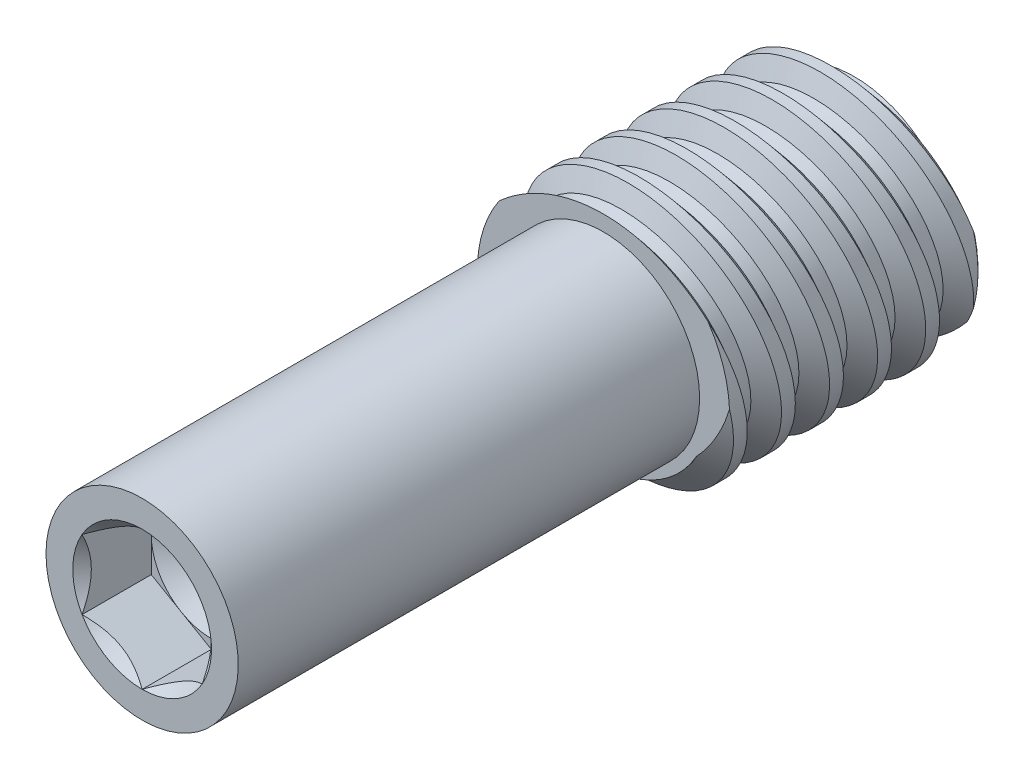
from build123d import *

# Parameters (mm, degrees)
LPATTERN1_COUNT     = 15
LPATTERN1_PITCH     = 0.79375
LPATTERN1_COL_COUNT = 2
LPATTERN1_COL_PITCH = 0.79375
CUT_EXTRUDE10_DEPTH = 1.143
SKETCH27_W          = 8.329206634
SKETCH27_H          = 2.117381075
SKETCH27_W_2        = 1.807192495
SKETCH27_H_2        = 3.411174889


with BuildPart() as part:
    # Sketch22 → Revolve1 (revolve)
    with BuildSketch(Plane(origin=(0, 0, 0), x_dir=(0, 0, -1), z_dir=(1, 0, 0)), mode=Mode.PRIVATE) as revolve1_sk:
        Polygon((-6.018054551, 0), (-6.018054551, 1.66624), (-5.726376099, 2.0828), (5.704045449, 2.0828), (6.681945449, 1.1049), (6.018054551, 0), align=None)
    revolve(revolve1_sk.sketch.rotate(Axis((0, 0, -6.018054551), (0, 0, -1)), 180), axis=Axis((0, 0, -6.018054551), (0, 0, -1)))

    # Sketch6 → Cut-Revolve8 (revolve, cut)
    with BuildSketch(Plane(origin=(0, 0, 0), x_dir=(0, 0, -1), z_dir=(1, 0, 0))):
        Polygon((5.072254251, 1.762908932), (4.877324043, 1.725765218), (4.553242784, 2.101371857), (5.235498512, 2.231374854), align=None)
    cut_revolve8 = revolve(axis=Axis((0, 0.162231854, -6.158563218), (0, -0.18718091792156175, 0.9823254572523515)), mode=Mode.SUBTRACT)

    # LPattern1: Cut-Revolve8 ×15
    with Locations(*[(0, 0, i * LPATTERN1_PITCH) for i in range(1, LPATTERN1_COUNT)]):
        add(cut_revolve8, mode=Mode.SUBTRACT)

    # LPattern1 col: Cut-Revolve8 ×2
    with Locations(*[(0, 0, -i * LPATTERN1_COL_PITCH) for i in range(1, LPATTERN1_COL_COUNT)]):
        add(cut_revolve8, mode=Mode.SUBTRACT)

    # Sketch23 → Cut-Extrude10 (cut)
    with BuildSketch(Plane.XY.offset(6.018054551)):
        Polygon((0, 1.14567944), (-0.9921875, 0.57283972), (-0.9921875, -0.57283972), (0, -1.14567944), (0.9921875, -0.57283972), (0.9921875, 0.57283972), align=None)
    extrude(amount=-CUT_EXTRUDE10_DEPTH, mode=Mode.SUBTRACT)

    # Cut-Extrude11 cone 1 section (on through the dimple's axis) → Cut-Extrude11 (revolve, cut)
    with BuildSketch(Plane(origin=(0, 0, 6.018054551), x_dir=(0, -1, 0), z_dir=(1, 0, 0))):
        Polygon((0, 0), (1.14567944, 0), (0, 1.14567944), align=None)
    revolve(axis=Axis((0, 0, 6.018054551), (0, 0, -1)), mode=Mode.SUBTRACT)

    # Cut-Extrude12 cone 1 section (on through the dimple's axis) → Cut-Extrude12 (revolve, cut)
    with BuildSketch(Plane(origin=(0, 0, 4.875054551), x_dir=(0, -1, 0), z_dir=(1, 0, 0))):
        Polygon((0, 0), (0.9921875, 0), (0, 0.596166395), align=None)
    revolve(axis=Axis((0, 0, 4.875054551), (0, 0, -1)), mode=Mode.SUBTRACT)

    # Sketch27 → Cut-Revolve9 (revolve, cut)
    with BuildSketch(Plane(origin=(0, 0, 0), x_dir=(0, 0, -1), z_dir=(1, 0, 0)), mode=Mode.PRIVATE) as cut_revolve9_sk:
        with Locations((-2.562657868, 2.646190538)):
            Rectangle(SKETCH27_W, SKETCH27_H)
        with Locations((6.645741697, 1.705587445)):
            Rectangle(SKETCH27_W_2, SKETCH27_H_2)
    revolve(cut_revolve9_sk.sketch.rotate(Axis((0, 0, 0), (0, 0, 1)), 125.657011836), axis=Axis((0, 0, 0), (0, 0, 1)), mode=Mode.SUBTRACT)


solid = part.part
